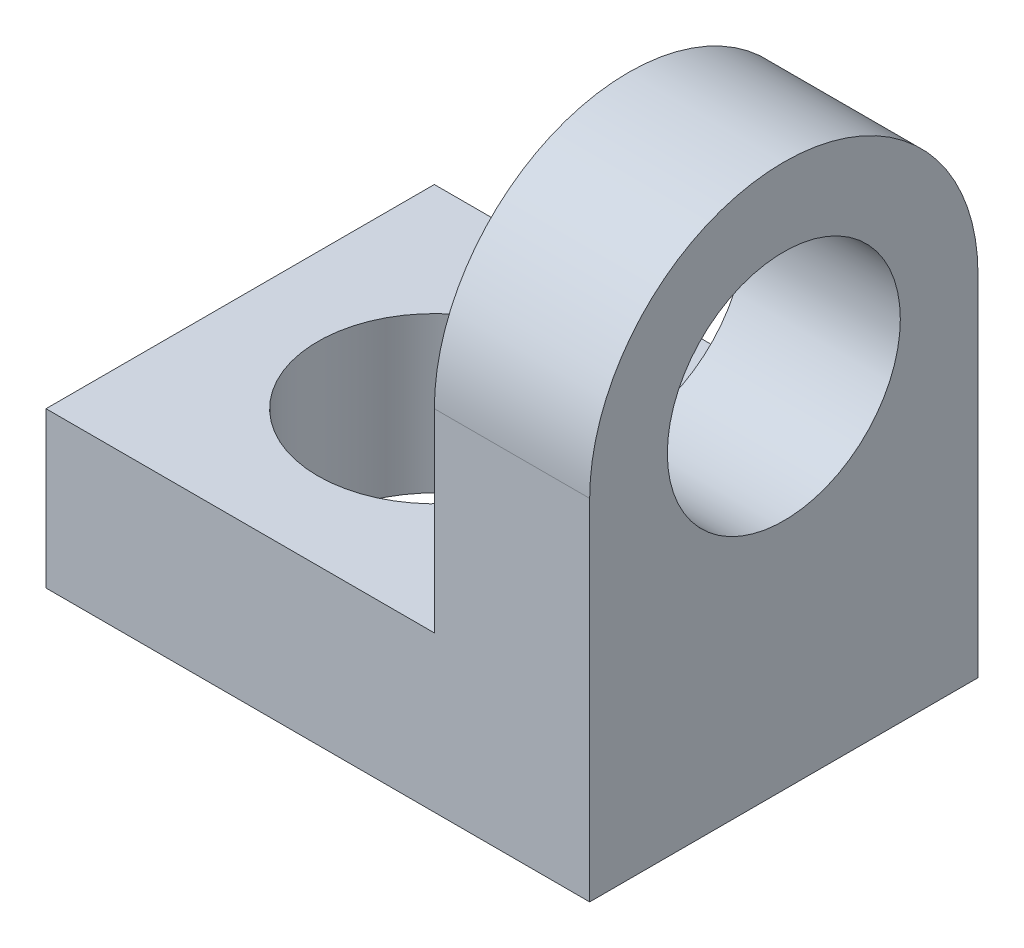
from build123d import *

# Parameters (mm, degrees)
SKETCH_1_W          = 28
SKETCH_1_H          = 20
EXTRUDE_1_DEPTH     = 8
SKETCH_2_W          = 8
SKETCH_2_H          = 20
EXTRUDE_2_DEPTH     = 20
FILLET_1_RADIUS     = 10
FILLET_1_LENGTH     = 8
SKETCH_3_R          = 6
CUT_EXTRUDE_1_DEPTH = 45.362146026
SKETCH_4_R          = 6
CUT_EXTRUDE_2_DEPTH = 40.799497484


with BuildPart() as part:
    # Sketch 1 → Extrude 1 (new body)
    with BuildSketch(Plane(origin=(0, 0, 0), x_dir=(1, 0, 0), z_dir=(0, 1, 0))):
        with Locations((14, 10)):
            Rectangle(SKETCH_1_W, SKETCH_1_H)
    extrude(amount=EXTRUDE_1_DEPTH)

    # Sketch 2 → Extrude 2 (add)
    with BuildSketch(Plane(origin=(0, 8, 0), x_dir=(1, 0, 0), z_dir=(0, 1, 0))):
        with Locations((24, 10)):
            Rectangle(SKETCH_2_W, SKETCH_2_H)
    extrude(amount=EXTRUDE_2_DEPTH)

    # Fillet 1: full round fillet: the end face becomes a half cylinder, R = half its width
    fillet_1_face = Plane((24, 28, -10), x_dir=(1, 0, 0), z_dir=(0, 1, 0))  # on the end face: x along it, z out of the body
    fillet_1_slab = fillet_1_face.offset(-FILLET_1_RADIUS / 2) * Box(FILLET_1_LENGTH, 2 * FILLET_1_RADIUS, FILLET_1_RADIUS, mode=Mode.PRIVATE)  # the body's end, R deep
    fillet_1_round = Plane((24, 18, -10), x_dir=(0, 1, 0), z_dir=(1, 0, 0)) * Cylinder(FILLET_1_RADIUS, FILLET_1_LENGTH, mode=Mode.PRIVATE)  # its axis R under the face
    add(fillet_1_slab - fillet_1_round, mode=Mode.SUBTRACT)

    # Sketch 3 → Cut-Extrude 1 (cut, through all)
    with BuildSketch(Plane(origin=(28, 0, 0), x_dir=(0, 0, -1), z_dir=(1, 0, 0))):
        with Locations((10, 18)):
            Circle(SKETCH_3_R)
    extrude(amount=-CUT_EXTRUDE_1_DEPTH, mode=Mode.SUBTRACT)

    # Sketch 4 → Cut-Extrude 2 (cut, through all)
    with BuildSketch(Plane(origin=(0, 8, 0), x_dir=(1, 0, 0), z_dir=(0, 1, 0))):
        with Locations(Location((10, 10, 0), (0, 0, 270))):
            Circle(SKETCH_4_R)
    extrude(amount=-CUT_EXTRUDE_2_DEPTH, mode=Mode.SUBTRACT)


solid = part.part
